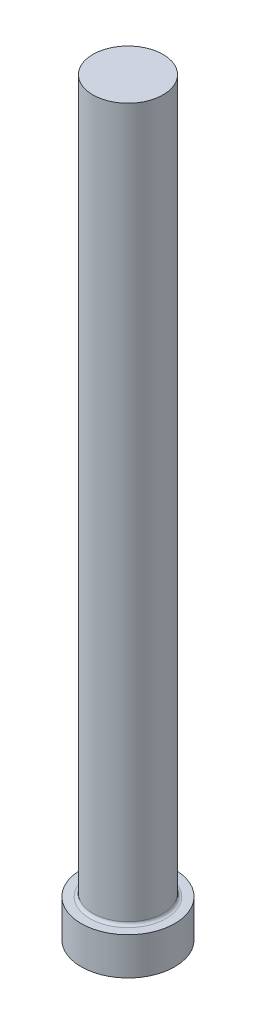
ISO-10303-21;
HEADER;
FILE_DESCRIPTION(('STEP AP214'),'2;1');
FILE_NAME('part.step','',(''),(''),'','','');
FILE_SCHEMA(('AUTOMOTIVE_DESIGN { 1 0 10303 214 1 1 1 1 }'));
ENDSEC;
DATA;
#1=APPLICATION_CONTEXT('core data for automotive mechanical design processes');
#2=APPLICATION_PROTOCOL_DEFINITION('international standard','automotive_design',2000,#1);
#3=PRODUCT_CONTEXT('',#1,'mechanical');
#4=PRODUCT('Part','Part','',(#3));
#5=PRODUCT_RELATED_PRODUCT_CATEGORY('part','',(#4));
#6=PRODUCT_DEFINITION_FORMATION('','',#4);
#7=PRODUCT_DEFINITION_CONTEXT('part definition',#1,'design');
#8=PRODUCT_DEFINITION('design','',#6,#7);
#9=PRODUCT_DEFINITION_SHAPE('','',#8);
#10=(LENGTH_UNIT() NAMED_UNIT(*) SI_UNIT(.MILLI.,.METRE.));
#11=(NAMED_UNIT(*) PLANE_ANGLE_UNIT() SI_UNIT($,.RADIAN.));
#12=(NAMED_UNIT(*) SI_UNIT($,.STERADIAN.) SOLID_ANGLE_UNIT());
#13=UNCERTAINTY_MEASURE_WITH_UNIT(LENGTH_MEASURE(1.E-05),#10,'distance_accuracy_value','');
#14=(GEOMETRIC_REPRESENTATION_CONTEXT(3) GLOBAL_UNCERTAINTY_ASSIGNED_CONTEXT((#13)) GLOBAL_UNIT_ASSIGNED_CONTEXT((#10,
#11,#12)) REPRESENTATION_CONTEXT('',''));
#15=CARTESIAN_POINT('',(0.,0.,0.));
#16=DIRECTION('',(0.,0.,1.));
#17=DIRECTION('',(1.,0.,0.));
#18=AXIS2_PLACEMENT_3D('',#15,#16,#17);
#19=CARTESIAN_POINT('',(0.,63.5,0.));
#20=DIRECTION('',(0.,-1.,0.));
#21=DIRECTION('',(0.,0.,-1.));
#22=AXIS2_PLACEMENT_3D('',#19,#20,#21);
#23=PLANE('',#22);
#24=CARTESIAN_POINT('',(0.,63.5,0.));
#25=DIRECTION('',(0.,1.,0.));
#26=DIRECTION('',(0.,0.,1.));
#27=AXIS2_PLACEMENT_3D('',#24,#25,#26);
#28=CIRCLE('',#27,2.9718);
#29=CARTESIAN_POINT('',(0.,63.5,2.9718));
#30=VERTEX_POINT('',#29);
#31=EDGE_CURVE('E10',#30,#30,#28,.T.);
#32=ORIENTED_EDGE('',*,*,#31,.T.);
#33=EDGE_LOOP('',(#32));
#34=FACE_BOUND('',#33,.T.);
#35=ADVANCED_FACE('F30',(#34),#23,.F.);
#36=CARTESIAN_POINT('',(0.,0.,0.));
#37=DIRECTION('',(0.,1.,0.));
#38=DIRECTION('',(0.,0.,1.));
#39=AXIS2_PLACEMENT_3D('',#36,#37,#38);
#40=CYLINDRICAL_SURFACE('',#39,2.9718);
#41=ORIENTED_EDGE('',*,*,#31,.F.);
#42=EDGE_LOOP('',(#41));
#43=FACE_BOUND('',#42,.T.);
#44=CARTESIAN_POINT('',(0.,3.429,0.));
#45=DIRECTION('',(0.,1.,0.));
#46=DIRECTION('',(0.,0.,1.));
#47=AXIS2_PLACEMENT_3D('',#44,#45,#46);
#48=CIRCLE('',#47,2.9718);
#49=CARTESIAN_POINT('',(0.,3.429,2.9718));
#50=VERTEX_POINT('',#49);
#51=EDGE_CURVE('E36',#50,#50,#48,.T.);
#52=ORIENTED_EDGE('',*,*,#51,.T.);
#53=EDGE_LOOP('',(#52));
#54=FACE_BOUND('',#53,.T.);
#55=ADVANCED_FACE('F65',(#43,#54),#40,.T.);
#56=CARTESIAN_POINT('',(0.,3.429,0.));
#57=DIRECTION('',(0.,1.,0.));
#58=DIRECTION('',(0.,0.,1.));
#59=AXIS2_PLACEMENT_3D('',#56,#57,#58);
#60=TOROIDAL_SURFACE('',#59,3.2258,0.254);
#61=ORIENTED_EDGE('',*,*,#51,.F.);
#62=EDGE_LOOP('',(#61));
#63=FACE_BOUND('',#62,.T.);
#64=CARTESIAN_POINT('',(0.,3.175,0.));
#65=DIRECTION('',(0.,1.,0.));
#66=DIRECTION('',(0.,0.,1.));
#67=AXIS2_PLACEMENT_3D('',#64,#65,#66);
#68=CIRCLE('',#67,3.2258);
#69=CARTESIAN_POINT('',(0.,3.175,3.2258));
#70=VERTEX_POINT('',#69);
#71=EDGE_CURVE('E40',#70,#70,#68,.T.);
#72=ORIENTED_EDGE('',*,*,#71,.T.);
#73=EDGE_LOOP('',(#72));
#74=FACE_BOUND('',#73,.T.);
#75=ADVANCED_FACE('F69',(#63,#74),#60,.F.);
#76=CARTESIAN_POINT('',(3.9624,3.175,0.));
#77=DIRECTION('',(0.,-1.,0.));
#78=DIRECTION('',(0.,0.,-1.));
#79=AXIS2_PLACEMENT_3D('',#76,#77,#78);
#80=PLANE('',#79);
#81=ORIENTED_EDGE('',*,*,#71,.F.);
#82=EDGE_LOOP('',(#81));
#83=FACE_BOUND('',#82,.T.);
#84=CARTESIAN_POINT('',(0.,3.175,0.));
#85=DIRECTION('',(0.,1.,0.));
#86=DIRECTION('',(0.,0.,1.));
#87=AXIS2_PLACEMENT_3D('',#84,#85,#86);
#88=CIRCLE('',#87,3.9624);
#89=CARTESIAN_POINT('',(0.,3.175,3.9624));
#90=VERTEX_POINT('',#89);
#91=EDGE_CURVE('E44',#90,#90,#88,.T.);
#92=ORIENTED_EDGE('',*,*,#91,.T.);
#93=EDGE_LOOP('',(#92));
#94=FACE_BOUND('',#93,.T.);
#95=ADVANCED_FACE('F61',(#83,#94),#80,.F.);
#96=CARTESIAN_POINT('',(0.,0.,0.));
#97=DIRECTION('',(0.,1.,0.));
#98=DIRECTION('',(0.,0.,1.));
#99=AXIS2_PLACEMENT_3D('',#96,#97,#98);
#100=CYLINDRICAL_SURFACE('',#99,3.9624);
#101=ORIENTED_EDGE('',*,*,#91,.F.);
#102=EDGE_LOOP('',(#101));
#103=FACE_BOUND('',#102,.T.);
#104=CARTESIAN_POINT('',(0.,0.,0.));
#105=DIRECTION('',(0.,1.,0.));
#106=DIRECTION('',(0.,0.,1.));
#107=AXIS2_PLACEMENT_3D('',#104,#105,#106);
#108=CIRCLE('',#107,3.9624);
#109=CARTESIAN_POINT('',(0.,0.,3.9624));
#110=VERTEX_POINT('',#109);
#111=EDGE_CURVE('E49',#110,#110,#108,.T.);
#112=ORIENTED_EDGE('',*,*,#111,.T.);
#113=EDGE_LOOP('',(#112));
#114=FACE_BOUND('',#113,.T.);
#115=ADVANCED_FACE('F53',(#103,#114),#100,.T.);
#116=CARTESIAN_POINT('',(0.,0.,0.));
#117=DIRECTION('',(0.,1.,0.));
#118=DIRECTION('',(0.,0.,1.));
#119=AXIS2_PLACEMENT_3D('',#116,#117,#118);
#120=PLANE('',#119);
#121=ORIENTED_EDGE('',*,*,#111,.F.);
#122=EDGE_LOOP('',(#121));
#123=FACE_BOUND('',#122,.T.);
#124=ADVANCED_FACE('F55',(#123),#120,.F.);
#125=CLOSED_SHELL('',(#35,#55,#75,#95,#115,#124));
#126=MANIFOLD_SOLID_BREP('B2',#125);
#127=ADVANCED_BREP_SHAPE_REPRESENTATION('',(#18,#126),#14);
#128=SHAPE_DEFINITION_REPRESENTATION(#9,#127);
ENDSEC;
END-ISO-10303-21;
